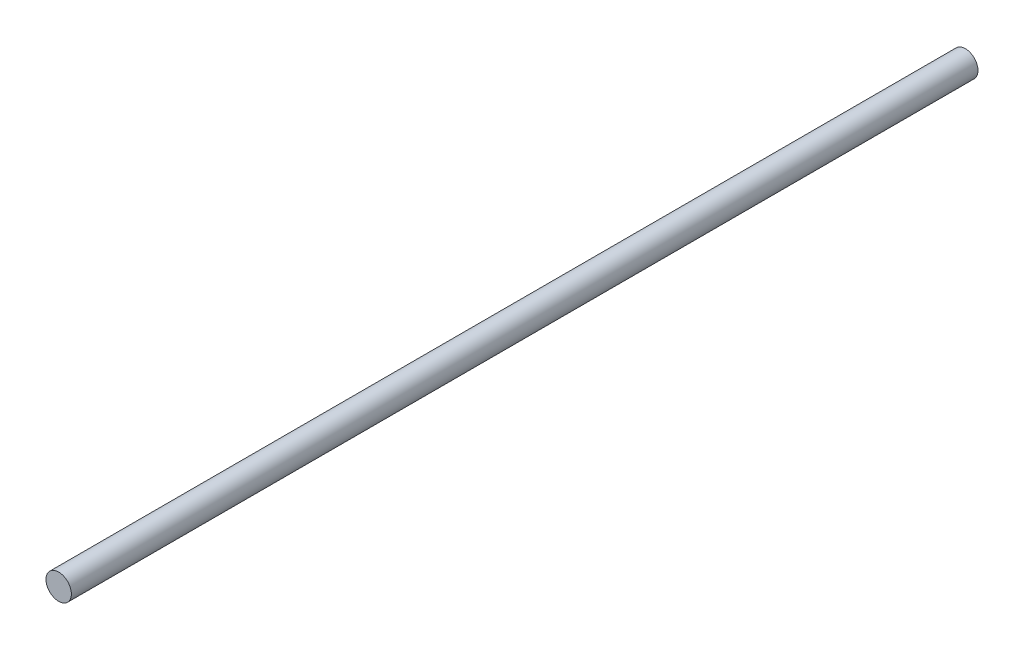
from build123d import *

# Parameters (mm, degrees)
SKIZZE1_R                       = 1.4
AUFSATZ_LINEAR_AUSTRAGEN1_DEPTH = 50


with BuildPart() as part:
    # Skizze1 → Aufsatz-Linear austragen1 (new, symmetric)
    with BuildSketch(Plane.XY):
        Circle(SKIZZE1_R)
    extrude(amount=AUFSATZ_LINEAR_AUSTRAGEN1_DEPTH, both=True)


solid = part.part
